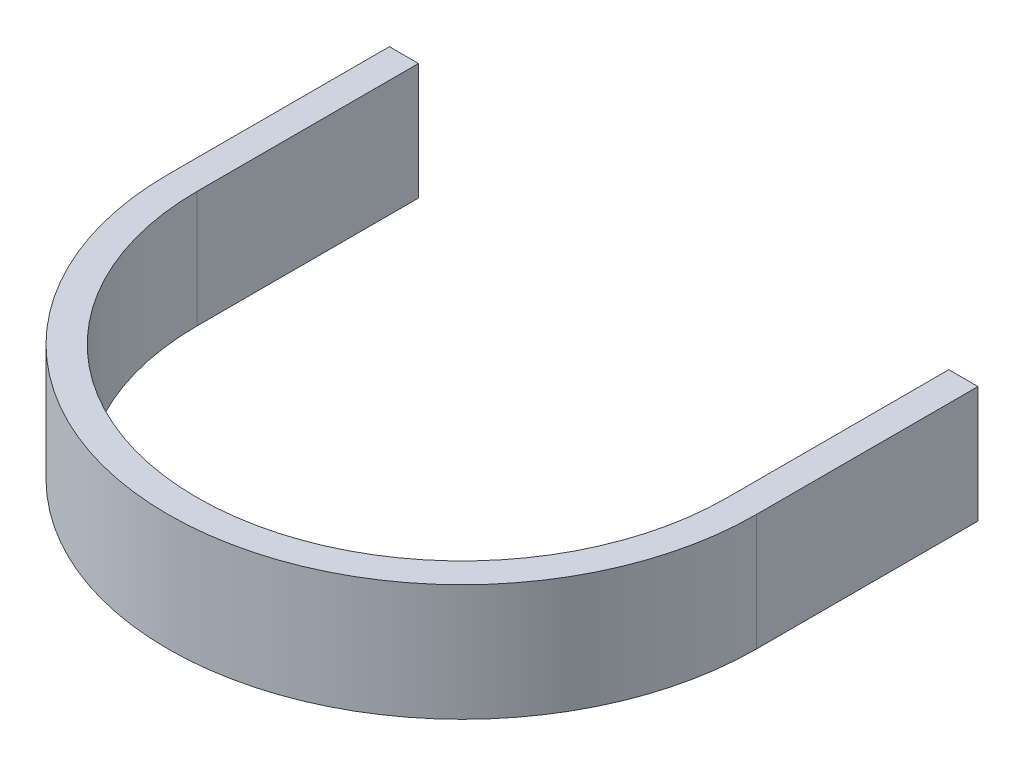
from build123d import *

# Parameters (mm, degrees)
BOSS_EXTRU_1_DEPTH = 20


with BuildPart() as part:
    # Esquisse1 → Boss.-Extru.1 (new body)
    with BuildSketch(Plane(origin=(0, 0, 0), x_dir=(1, 0, 0), z_dir=(0, 1, 0))):
        with BuildLine():
            Line((50.5, -30), (50.5, 8))
            Line((50.5, 8), (45.5, 8))
            Line((45.5, 8), (45.5, -30))
            ThreePointArc((45.5, -30), (0, -75.5), (-45.5, -30))
            Line((-45.5, -30), (-45.5, 8))
            Line((-45.5, 8), (-50.5, 8))
            Line((-50.5, 8), (-50.5, -30))
            ThreePointArc((-50.5, -30), (0, -80.5), (50.5, -30))
        make_face()
    extrude(amount=BOSS_EXTRU_1_DEPTH)


solid = part.part
